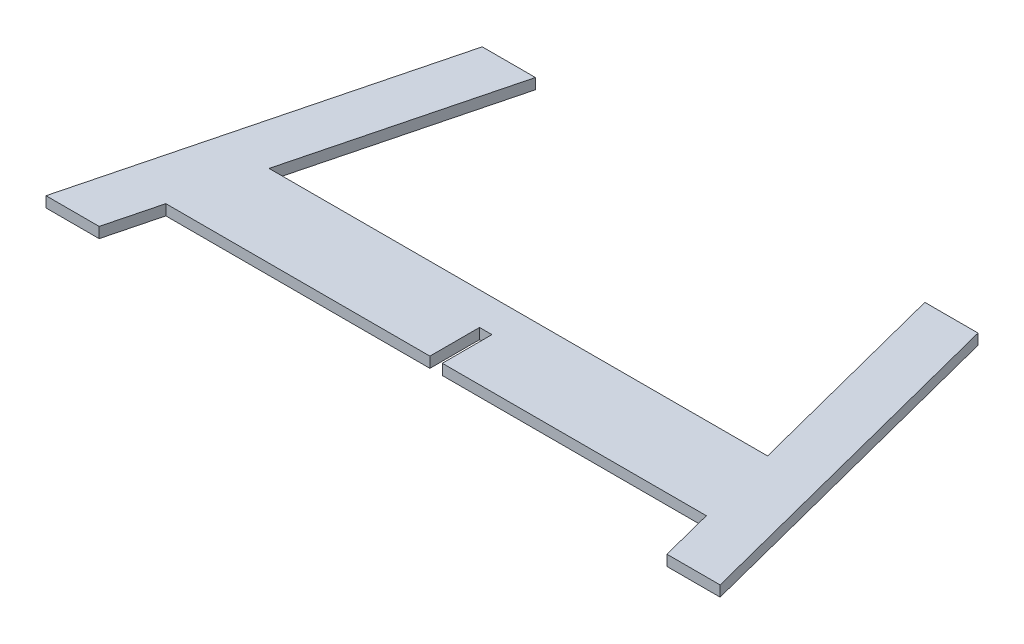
from build123d import *

# Parameters (mm, degrees)
BOSS_EXTRUDE1_DEPTH = 12


with BuildPart() as part:
    # Sketch1 → Boss-Extrude1 (new body)
    with BuildSketch(Plane(origin=(0, 0, 0), x_dir=(1, 0, 0), z_dir=(0, 1, 0))):
        Polygon((-5.131480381, 180.690415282), (54.868519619, 180.690415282), (-6.59747207, -58.502158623), (555.794060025, -58.189085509), (494.408519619, 180.690415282), (554.408519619, 180.690415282), (655.076907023, -211.056793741), (595.076907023, -211.056793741), (579.690016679, -151.17929393), (281.638519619, -151.17929393), (281.638519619, -95.181083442), (267.638519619, -95.181083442), (267.638519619, -151.181083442), (-30.412977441, -151.17929393), (-45.799867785, -211.056793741), (-105.799867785, -211.056793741), align=None)
    extrude(amount=BOSS_EXTRUDE1_DEPTH)


solid = part.part
